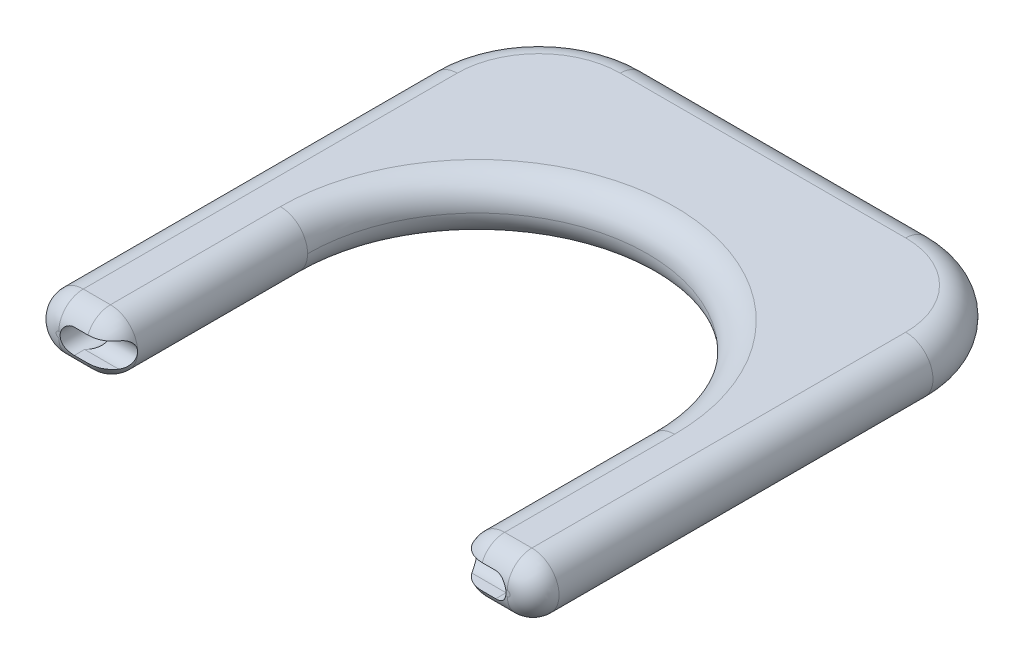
ISO-10303-21;
HEADER;
FILE_DESCRIPTION(('STEP AP214'),'2;1');
FILE_NAME('part.step','',(''),(''),'','','');
FILE_SCHEMA(('AUTOMOTIVE_DESIGN { 1 0 10303 214 1 1 1 1 }'));
ENDSEC;
DATA;
#1=APPLICATION_CONTEXT('core data for automotive mechanical design processes');
#2=APPLICATION_PROTOCOL_DEFINITION('international standard','automotive_design',2000,#1);
#3=PRODUCT_CONTEXT('',#1,'mechanical');
#4=PRODUCT('Part','Part','',(#3));
#5=PRODUCT_RELATED_PRODUCT_CATEGORY('part','',(#4));
#6=PRODUCT_DEFINITION_FORMATION('','',#4);
#7=PRODUCT_DEFINITION_CONTEXT('part definition',#1,'design');
#8=PRODUCT_DEFINITION('design','',#6,#7);
#9=PRODUCT_DEFINITION_SHAPE('','',#8);
#10=(LENGTH_UNIT() NAMED_UNIT(*) SI_UNIT(.MILLI.,.METRE.));
#11=(NAMED_UNIT(*) PLANE_ANGLE_UNIT() SI_UNIT($,.RADIAN.));
#12=(NAMED_UNIT(*) SI_UNIT($,.STERADIAN.) SOLID_ANGLE_UNIT());
#13=UNCERTAINTY_MEASURE_WITH_UNIT(LENGTH_MEASURE(1.E-05),#10,'distance_accuracy_value','');
#14=(GEOMETRIC_REPRESENTATION_CONTEXT(3) GLOBAL_UNCERTAINTY_ASSIGNED_CONTEXT((#13)) GLOBAL_UNIT_ASSIGNED_CONTEXT((#10,
#11,#12)) REPRESENTATION_CONTEXT('',''));
#15=CARTESIAN_POINT('',(0.,0.,0.));
#16=DIRECTION('',(0.,0.,1.));
#17=DIRECTION('',(1.,0.,0.));
#18=AXIS2_PLACEMENT_3D('',#15,#16,#17);
#19=CARTESIAN_POINT('',(32.,0.,0.));
#20=DIRECTION('',(0.,0.,-1.));
#21=DIRECTION('',(-1.,0.,0.));
#22=AXIS2_PLACEMENT_3D('',#19,#20,#21);
#23=PLANE('',#22);
#24=CARTESIAN_POINT('',(32.,0.,0.));
#25=DIRECTION('',(0.,0.,-1.));
#26=DIRECTION('',(-1.,0.,0.));
#27=AXIS2_PLACEMENT_3D('',#24,#25,#26);
#28=CIRCLE('',#27,0.199999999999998);
#29=CARTESIAN_POINT('',(32.,-0.199999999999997,0.));
#30=VERTEX_POINT('',#29);
#31=CARTESIAN_POINT('',(32.,0.199999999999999,0.));
#32=VERTEX_POINT('',#31);
#33=EDGE_CURVE('E648',#30,#32,#28,.F.);
#34=ORIENTED_EDGE('',*,*,#33,.T.);
#35=DIRECTION('',(1.,0.,0.));
#36=VECTOR('',#35,1.);
#37=CARTESIAN_POINT('',(30.,0.199999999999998,0.));
#38=LINE('',#37,#36);
#39=CARTESIAN_POINT('',(31.8774964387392,0.199999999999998,0.));
#40=VERTEX_POINT('',#39);
#41=EDGE_CURVE('E656',#32,#40,#38,.F.);
#42=ORIENTED_EDGE('',*,*,#41,.T.);
#43=CARTESIAN_POINT('',(31.,0.,0.));
#44=DIRECTION('',(0.,0.,1.));
#45=DIRECTION('',(1.,0.,0.));
#46=AXIS2_PLACEMENT_3D('',#43,#44,#45);
#47=CIRCLE('',#46,0.899999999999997);
#48=CARTESIAN_POINT('',(31.8774964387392,-0.199999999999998,0.));
#49=VERTEX_POINT('',#48);
#50=EDGE_CURVE('E531',#49,#40,#47,.T.);
#51=ORIENTED_EDGE('',*,*,#50,.F.);
#52=DIRECTION('',(-1.,0.,0.));
#53=VECTOR('',#52,1.);
#54=CARTESIAN_POINT('',(32.,-0.199999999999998,0.));
#55=LINE('',#54,#53);
#56=EDGE_CURVE('E649',#49,#30,#55,.F.);
#57=ORIENTED_EDGE('',*,*,#56,.T.);
#58=EDGE_LOOP('',(#34,#42,#51,#57));
#59=FACE_BOUND('',#58,.T.);
#60=ADVANCED_FACE('F41',(#59),#23,.F.);
#61=CARTESIAN_POINT('',(-1.,0.,0.));
#62=DIRECTION('',(0.,0.,1.));
#63=DIRECTION('',(1.,0.,0.));
#64=AXIS2_PLACEMENT_3D('',#61,#62,#63);
#65=PLANE('',#64);
#66=CARTESIAN_POINT('',(0.,0.,0.));
#67=DIRECTION('',(0.,0.,1.));
#68=DIRECTION('',(1.,0.,0.));
#69=AXIS2_PLACEMENT_3D('',#66,#67,#68);
#70=CIRCLE('',#69,0.9);
#71=CARTESIAN_POINT('',(-0.877496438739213,0.199999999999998,0.));
#72=VERTEX_POINT('',#71);
#73=CARTESIAN_POINT('',(-0.877496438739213,-0.199999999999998,0.));
#74=VERTEX_POINT('',#73);
#75=EDGE_CURVE('E521',#72,#74,#70,.T.);
#76=ORIENTED_EDGE('',*,*,#75,.F.);
#77=DIRECTION('',(-1.,0.,0.));
#78=VECTOR('',#77,1.);
#79=CARTESIAN_POINT('',(-1.,0.199999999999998,0.));
#80=LINE('',#79,#78);
#81=CARTESIAN_POINT('',(-1.,0.199999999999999,0.));
#82=VERTEX_POINT('',#81);
#83=EDGE_CURVE('E606',#72,#82,#80,.T.);
#84=ORIENTED_EDGE('',*,*,#83,.T.);
#85=CARTESIAN_POINT('',(-1.,0.,0.));
#86=DIRECTION('',(0.,0.,1.));
#87=DIRECTION('',(1.,0.,0.));
#88=AXIS2_PLACEMENT_3D('',#85,#86,#87);
#89=CIRCLE('',#88,0.199999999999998);
#90=CARTESIAN_POINT('',(-1.,-0.199999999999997,0.));
#91=VERTEX_POINT('',#90);
#92=EDGE_CURVE('E410',#82,#91,#89,.T.);
#93=ORIENTED_EDGE('',*,*,#92,.T.);
#94=DIRECTION('',(1.,0.,0.));
#95=VECTOR('',#94,1.);
#96=CARTESIAN_POINT('',(-1.,-0.199999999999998,0.));
#97=LINE('',#96,#95);
#98=EDGE_CURVE('E609',#91,#74,#97,.T.);
#99=ORIENTED_EDGE('',*,*,#98,.T.);
#100=EDGE_LOOP('',(#76,#84,#93,#99));
#101=FACE_BOUND('',#100,.T.);
#102=ADVANCED_FACE('F461',(#101),#65,.T.);
#103=CARTESIAN_POINT('',(30.,0.,0.));
#104=DIRECTION('',(0.,0.,-1.));
#105=DIRECTION('',(-1.,0.,0.));
#106=AXIS2_PLACEMENT_3D('',#103,#104,#105);
#107=CYLINDRICAL_SURFACE('',#106,2.);
#108=CARTESIAN_POINT('',(30.,0.,-1.8));
#109=DIRECTION('',(0.,0.,-1.));
#110=DIRECTION('',(-1.,0.,0.));
#111=AXIS2_PLACEMENT_3D('',#108,#109,#110);
#112=CIRCLE('',#111,2.);
#113=CARTESIAN_POINT('',(30.,-2.,-1.8));
#114=VERTEX_POINT('',#113);
#115=CARTESIAN_POINT('',(27.9999999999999,0.,-1.80000000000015));
#116=VERTEX_POINT('',#115);
#117=EDGE_CURVE('E350',#114,#116,#112,.T.);
#118=ORIENTED_EDGE('',*,*,#117,.T.);
#119=CARTESIAN_POINT('',(30.,0.,-1.8));
#120=DIRECTION('',(0.,0.,-1.));
#121=DIRECTION('',(-1.,0.,0.));
#122=AXIS2_PLACEMENT_3D('',#119,#120,#121);
#123=CIRCLE('',#122,2.);
#124=CARTESIAN_POINT('',(30.,2.,-1.8));
#125=VERTEX_POINT('',#124);
#126=EDGE_CURVE('E355',#116,#125,#123,.T.);
#127=ORIENTED_EDGE('',*,*,#126,.T.);
#128=DIRECTION('',(0.,0.,-1.));
#129=VECTOR('',#128,1.);
#130=CARTESIAN_POINT('',(30.,2.,0.));
#131=LINE('',#130,#129);
#132=CARTESIAN_POINT('',(30.,2.,-14.3));
#133=VERTEX_POINT('',#132);
#134=EDGE_CURVE('E516',#125,#133,#131,.T.);
#135=ORIENTED_EDGE('',*,*,#134,.T.);
#136=CARTESIAN_POINT('',(30.,0.,-14.3));
#137=DIRECTION('',(0.,0.,1.));
#138=DIRECTION('',(1.,0.,0.));
#139=AXIS2_PLACEMENT_3D('',#136,#137,#138);
#140=CIRCLE('',#139,2.);
#141=CARTESIAN_POINT('',(28.,0.,-14.3));
#142=VERTEX_POINT('',#141);
#143=EDGE_CURVE('E490',#142,#133,#140,.F.);
#144=ORIENTED_EDGE('',*,*,#143,.F.);
#145=CARTESIAN_POINT('',(30.,-2.,-14.3));
#146=VERTEX_POINT('',#145);
#147=EDGE_CURVE('E500',#146,#142,#140,.F.);
#148=ORIENTED_EDGE('',*,*,#147,.F.);
#149=DIRECTION('',(0.,0.,-1.));
#150=VECTOR('',#149,1.);
#151=CARTESIAN_POINT('',(30.,-2.,0.));
#152=LINE('',#151,#150);
#153=EDGE_CURVE('E498',#114,#146,#152,.T.);
#154=ORIENTED_EDGE('',*,*,#153,.F.);
#155=EDGE_LOOP('',(#118,#127,#135,#144,#148,#154));
#156=FACE_BOUND('',#155,.T.);
#157=ADVANCED_FACE('F467',(#156),#107,.T.);
#158=CARTESIAN_POINT('',(1.,0.,-29.305));
#159=DIRECTION('',(0.,0.,1.));
#160=DIRECTION('',(1.,0.,0.));
#161=AXIS2_PLACEMENT_3D('',#158,#159,#160);
#162=CYLINDRICAL_SURFACE('',#161,2.);
#163=DIRECTION('',(0.,0.,1.));
#164=VECTOR('',#163,1.);
#165=CARTESIAN_POINT('',(1.,2.,-29.305));
#166=LINE('',#165,#164);
#167=CARTESIAN_POINT('',(1.,2.,-14.3));
#168=VERTEX_POINT('',#167);
#169=CARTESIAN_POINT('',(1.,2.,-1.8));
#170=VERTEX_POINT('',#169);
#171=EDGE_CURVE('E560',#168,#170,#166,.T.);
#172=ORIENTED_EDGE('',*,*,#171,.T.);
#173=CARTESIAN_POINT('',(1.,0.,-1.8));
#174=DIRECTION('',(0.,0.,1.));
#175=DIRECTION('',(1.,0.,0.));
#176=AXIS2_PLACEMENT_3D('',#173,#174,#175);
#177=CIRCLE('',#176,2.);
#178=CARTESIAN_POINT('',(3.00000000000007,0.,-1.80000000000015));
#179=VERTEX_POINT('',#178);
#180=EDGE_CURVE('E618',#170,#179,#177,.F.);
#181=ORIENTED_EDGE('',*,*,#180,.T.);
#182=CARTESIAN_POINT('',(1.,0.,-1.8));
#183=DIRECTION('',(0.,0.,1.));
#184=DIRECTION('',(1.,0.,0.));
#185=AXIS2_PLACEMENT_3D('',#182,#183,#184);
#186=CIRCLE('',#185,2.);
#187=CARTESIAN_POINT('',(1.,-2.,-1.8));
#188=VERTEX_POINT('',#187);
#189=EDGE_CURVE('E385',#179,#188,#186,.F.);
#190=ORIENTED_EDGE('',*,*,#189,.T.);
#191=DIRECTION('',(0.,0.,1.));
#192=VECTOR('',#191,1.);
#193=CARTESIAN_POINT('',(1.,-2.,-29.305));
#194=LINE('',#193,#192);
#195=CARTESIAN_POINT('',(1.,-2.,-14.3));
#196=VERTEX_POINT('',#195);
#197=EDGE_CURVE('E496',#196,#188,#194,.T.);
#198=ORIENTED_EDGE('',*,*,#197,.F.);
#199=CARTESIAN_POINT('',(1.,0.,-14.3));
#200=DIRECTION('',(0.,0.,1.));
#201=DIRECTION('',(1.,0.,0.));
#202=AXIS2_PLACEMENT_3D('',#199,#200,#201);
#203=CIRCLE('',#202,2.);
#204=CARTESIAN_POINT('',(3.,0.,-14.3));
#205=VERTEX_POINT('',#204);
#206=EDGE_CURVE('E482',#205,#196,#203,.F.);
#207=ORIENTED_EDGE('',*,*,#206,.F.);
#208=EDGE_CURVE('E491',#168,#205,#203,.F.);
#209=ORIENTED_EDGE('',*,*,#208,.F.);
#210=EDGE_LOOP('',(#172,#181,#190,#198,#207,#209));
#211=FACE_BOUND('',#210,.T.);
#212=ADVANCED_FACE('F422',(#211),#162,.T.);
#213=CARTESIAN_POINT('',(0.,0.,-26.));
#214=DIRECTION('',(0.,0.,1.));
#215=DIRECTION('',(1.,0.,0.));
#216=AXIS2_PLACEMENT_3D('',#213,#214,#215);
#217=CYLINDRICAL_SURFACE('',#216,0.9);
#218=CARTESIAN_POINT('',(0.,0.,-26.));
#219=DIRECTION('',(0.,0.,1.));
#220=DIRECTION('',(1.,0.,0.));
#221=AXIS2_PLACEMENT_3D('',#218,#219,#220);
#222=CIRCLE('',#221,0.9);
#223=CARTESIAN_POINT('',(0.9,0.,-26.));
#224=VERTEX_POINT('',#223);
#225=EDGE_CURVE('E517',#224,#224,#222,.T.);
#226=ORIENTED_EDGE('',*,*,#225,.F.);
#227=EDGE_LOOP('',(#226));
#228=FACE_BOUND('',#227,.T.);
#229=DIRECTION('',(0.,0.,1.));
#230=VECTOR('',#229,1.);
#231=CARTESIAN_POINT('',(0.,0.9,0.));
#232=LINE('',#231,#230);
#233=CARTESIAN_POINT('',(0.,0.899999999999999,-0.9));
#234=VERTEX_POINT('',#233);
#235=CARTESIAN_POINT('',(0.,0.9,-0.141687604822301));
#236=VERTEX_POINT('',#235);
#237=EDGE_CURVE('E233',#234,#236,#232,.T.);
#238=ORIENTED_EDGE('',*,*,#237,.T.);
#239=CARTESIAN_POINT('',(-0.877496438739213,0.199999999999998,0.));
#240=CARTESIAN_POINT('',(-0.872085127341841,0.223747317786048,2.31582791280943E-06));
#241=CARTESIAN_POINT('',(-0.8657102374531,0.247260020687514,-0.000470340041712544));
#242=CARTESIAN_POINT('',(-0.851093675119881,0.293650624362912,-0.0022884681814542));
#243=CARTESIAN_POINT('',(-0.842852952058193,0.31652884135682,-0.00363349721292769));
#244=CARTESIAN_POINT('',(-0.815504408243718,0.383774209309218,-0.00884488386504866));
#245=CARTESIAN_POINT('',(-0.793714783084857,0.426992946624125,-0.0138890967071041));
#246=CARTESIAN_POINT('',(-0.743751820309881,0.509060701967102,-0.0262448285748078));
#247=CARTESIAN_POINT('',(-0.715588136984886,0.54791619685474,-0.0335529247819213));
#248=CARTESIAN_POINT('',(-0.653582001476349,0.620575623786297,-0.0494284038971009));
#249=CARTESIAN_POINT('',(-0.61973244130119,0.654373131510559,-0.0579973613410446));
#250=CARTESIAN_POINT('',(-0.545115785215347,0.717900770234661,-0.0757818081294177));
#251=CARTESIAN_POINT('',(-0.504068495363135,0.747299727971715,-0.0850067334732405));
#252=CARTESIAN_POINT('',(-0.417477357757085,0.798906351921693,-0.102338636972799));
#253=CARTESIAN_POINT('',(-0.371935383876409,0.82111699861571,-0.110446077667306));
#254=CARTESIAN_POINT('',(-0.27695481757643,0.857853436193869,-0.124403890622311));
#255=CARTESIAN_POINT('',(-0.227481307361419,0.87229877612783,-0.130230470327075));
#256=CARTESIAN_POINT('',(-0.126519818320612,0.892547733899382,-0.13852441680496));
#257=CARTESIAN_POINT('',(-0.0750323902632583,0.898353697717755,-0.140992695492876));
#258=CARTESIAN_POINT('',(0.0244385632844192,0.900939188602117,-0.142084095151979));
#259=CARTESIAN_POINT('',(0.0724019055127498,0.89834993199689,-0.140976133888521));
#260=CARTESIAN_POINT('',(0.143460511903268,0.888816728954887,-0.137008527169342));
#261=CARTESIAN_POINT('',(0.167034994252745,0.884686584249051,-0.135297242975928));
#262=CARTESIAN_POINT('',(0.213721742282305,0.874581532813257,-0.131177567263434));
#263=CARTESIAN_POINT('',(0.236834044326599,0.868606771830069,-0.128769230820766));
#264=CARTESIAN_POINT('',(0.259647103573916,0.861732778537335,-0.126049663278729));
#265=B_SPLINE_CURVE_WITH_KNOTS('',3,(#239,#240,#241,#242,#243,#244,#245,#246,#247,#248,#249,
#250,#251,#252,#253,#254,#255,#256,#257,#258,#259,#260,#261,#262,#263,#264),.UNSPECIFIED.,.F.,
.F.,(4,2,2,2,2,2,2,2,2,2,2,2,4),(0.,0.0730161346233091,0.145995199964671,0.291222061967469,
0.436230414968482,0.581421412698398,0.73469517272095,0.887905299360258,1.04267354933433,
1.19739976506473,1.34076991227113,1.41267928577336,1.48458297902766),.UNSPECIFIED.);
#266=EDGE_CURVE('E403',#236,#72,#265,.F.);
#267=ORIENTED_EDGE('',*,*,#266,.T.);
#268=ORIENTED_EDGE('',*,*,#75,.T.);
#269=CARTESIAN_POINT('',(-0.877496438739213,-0.199999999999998,0.));
#270=CARTESIAN_POINT('',(-0.872085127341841,-0.223747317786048,2.31582791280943E-06));
#271=CARTESIAN_POINT('',(-0.8657102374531,-0.247260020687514,-0.000470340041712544));
#272=CARTESIAN_POINT('',(-0.851093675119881,-0.293650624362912,-0.0022884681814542));
#273=CARTESIAN_POINT('',(-0.842852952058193,-0.31652884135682,-0.00363349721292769));
#274=CARTESIAN_POINT('',(-0.815504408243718,-0.383774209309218,-0.00884488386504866));
#275=CARTESIAN_POINT('',(-0.793714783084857,-0.426992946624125,-0.0138890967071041));
#276=CARTESIAN_POINT('',(-0.743751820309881,-0.509060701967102,-0.0262448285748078));
#277=CARTESIAN_POINT('',(-0.715588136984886,-0.54791619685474,-0.0335529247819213));
#278=CARTESIAN_POINT('',(-0.653582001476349,-0.620575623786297,-0.0494284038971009));
#279=CARTESIAN_POINT('',(-0.61973244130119,-0.654373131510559,-0.0579973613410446));
#280=CARTESIAN_POINT('',(-0.545115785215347,-0.717900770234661,-0.0757818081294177));
#281=CARTESIAN_POINT('',(-0.504068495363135,-0.747299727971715,-0.0850067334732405));
#282=CARTESIAN_POINT('',(-0.417477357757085,-0.798906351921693,-0.102338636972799));
#283=CARTESIAN_POINT('',(-0.371935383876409,-0.82111699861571,-0.110446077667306));
#284=CARTESIAN_POINT('',(-0.27695481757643,-0.857853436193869,-0.124403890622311));
#285=CARTESIAN_POINT('',(-0.227481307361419,-0.87229877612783,-0.130230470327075));
#286=CARTESIAN_POINT('',(-0.126519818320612,-0.892547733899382,-0.13852441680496));
#287=CARTESIAN_POINT('',(-0.0750323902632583,-0.898353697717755,-0.140992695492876));
#288=CARTESIAN_POINT('',(0.0244385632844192,-0.900939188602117,-0.142084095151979));
#289=CARTESIAN_POINT('',(0.0724019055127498,-0.89834993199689,-0.140976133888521));
#290=CARTESIAN_POINT('',(0.143460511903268,-0.888816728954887,-0.137008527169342));
#291=CARTESIAN_POINT('',(0.167034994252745,-0.884686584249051,-0.135297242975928));
#292=CARTESIAN_POINT('',(0.213721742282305,-0.874581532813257,-0.131177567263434));
#293=CARTESIAN_POINT('',(0.236834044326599,-0.868606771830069,-0.128769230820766));
#294=CARTESIAN_POINT('',(0.259647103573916,-0.861732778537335,-0.126049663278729));
#295=B_SPLINE_CURVE_WITH_KNOTS('',3,(#269,#270,#271,#272,#273,#274,#275,#276,#277,#278,#279,
#280,#281,#282,#283,#284,#285,#286,#287,#288,#289,#290,#291,#292,#293,#294),.UNSPECIFIED.,.F.,
.F.,(4,2,2,2,2,2,2,2,2,2,2,2,4),(0.,0.0730161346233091,0.145995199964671,0.291222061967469,
0.436230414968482,0.581421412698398,0.73469517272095,0.887905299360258,1.04267354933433,
1.19739976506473,1.34076991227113,1.41267928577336,1.48458297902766),.UNSPECIFIED.);
#296=CARTESIAN_POINT('',(0.,-0.9,-0.141687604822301));
#297=VERTEX_POINT('',#296);
#298=EDGE_CURVE('E411',#74,#297,#295,.T.);
#299=ORIENTED_EDGE('',*,*,#298,.T.);
#300=DIRECTION('',(0.,0.,-1.));
#301=VECTOR('',#300,1.);
#302=CARTESIAN_POINT('',(0.,-0.9,0.));
#303=LINE('',#302,#301);
#304=CARTESIAN_POINT('',(0.,-0.9,-0.9));
#305=VERTEX_POINT('',#304);
#306=EDGE_CURVE('E332',#297,#305,#303,.T.);
#307=ORIENTED_EDGE('',*,*,#306,.T.);
#308=CARTESIAN_POINT('',(0.,0.,-0.900000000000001));
#309=DIRECTION('',(0.707106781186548,0.,0.707106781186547));
#310=DIRECTION('',(-0.707106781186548,0.,0.707106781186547));
#311=AXIS2_PLACEMENT_3D('',#308,#309,#310);
#312=ELLIPSE('',#311,1.27279220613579,0.9);
#313=EDGE_CURVE('E242',#234,#305,#312,.F.);
#314=ORIENTED_EDGE('',*,*,#313,.F.);
#315=EDGE_LOOP('',(#238,#267,#268,#299,#307,#314));
#316=FACE_BOUND('',#315,.T.);
#317=ADVANCED_FACE('F417',(#228,#316),#217,.F.);
#318=CARTESIAN_POINT('',(32.,2.,0.));
#319=DIRECTION('',(0.,1.,0.));
#320=DIRECTION('',(0.,0.,1.));
#321=AXIS2_PLACEMENT_3D('',#318,#319,#320);
#322=PLANE('',#321);
#323=DIRECTION('',(0.,0.,1.));
#324=VECTOR('',#323,1.);
#325=CARTESIAN_POINT('',(-1.,2.,-29.305));
#326=LINE('',#325,#324);
#327=CARTESIAN_POINT('',(-1.,2.,-29.305));
#328=VERTEX_POINT('',#327);
#329=CARTESIAN_POINT('',(-1.,2.,-1.8));
#330=VERTEX_POINT('',#329);
#331=EDGE_CURVE('E507',#328,#330,#326,.T.);
#332=ORIENTED_EDGE('',*,*,#331,.T.);
#333=DIRECTION('',(-1.,0.,0.));
#334=VECTOR('',#333,1.);
#335=CARTESIAN_POINT('',(32.,2.,-1.8));
#336=LINE('',#335,#334);
#337=EDGE_CURVE('E598',#330,#170,#336,.F.);
#338=ORIENTED_EDGE('',*,*,#337,.T.);
#339=ORIENTED_EDGE('',*,*,#171,.F.);
#340=CARTESIAN_POINT('',(15.5,2.,-14.3));
#341=DIRECTION('',(0.,1.,0.));
#342=DIRECTION('',(0.,0.,1.));
#343=AXIS2_PLACEMENT_3D('',#340,#341,#342);
#344=CIRCLE('',#343,14.5);
#345=EDGE_CURVE('E250',#168,#133,#344,.F.);
#346=ORIENTED_EDGE('',*,*,#345,.T.);
#347=ORIENTED_EDGE('',*,*,#134,.F.);
#348=DIRECTION('',(1.,0.,0.));
#349=VECTOR('',#348,1.);
#350=CARTESIAN_POINT('',(32.,2.,-1.8));
#351=LINE('',#350,#349);
#352=CARTESIAN_POINT('',(32.,2.,-1.8));
#353=VERTEX_POINT('',#352);
#354=EDGE_CURVE('E605',#125,#353,#351,.T.);
#355=ORIENTED_EDGE('',*,*,#354,.T.);
#356=DIRECTION('',(0.,0.,-1.));
#357=VECTOR('',#356,1.);
#358=CARTESIAN_POINT('',(32.,2.,0.));
#359=LINE('',#358,#357);
#360=CARTESIAN_POINT('',(32.,2.,-29.305));
#361=VERTEX_POINT('',#360);
#362=EDGE_CURVE('E535',#353,#361,#359,.T.);
#363=ORIENTED_EDGE('',*,*,#362,.T.);
#364=CARTESIAN_POINT('',(26.,2.,-29.305));
#365=DIRECTION('',(0.,1.,0.));
#366=DIRECTION('',(1.,0.,0.));
#367=AXIS2_PLACEMENT_3D('',#364,#365,#366);
#368=CIRCLE('',#367,6.);
#369=CARTESIAN_POINT('',(26.,2.,-35.305));
#370=VERTEX_POINT('',#369);
#371=EDGE_CURVE('E540',#361,#370,#368,.T.);
#372=ORIENTED_EDGE('',*,*,#371,.T.);
#373=DIRECTION('',(-1.,0.,0.));
#374=VECTOR('',#373,1.);
#375=CARTESIAN_POINT('',(26.,2.,-35.305));
#376=LINE('',#375,#374);
#377=CARTESIAN_POINT('',(5.,2.,-35.305));
#378=VERTEX_POINT('',#377);
#379=EDGE_CURVE('E546',#370,#378,#376,.T.);
#380=ORIENTED_EDGE('',*,*,#379,.T.);
#381=CARTESIAN_POINT('',(5.,2.,-29.305));
#382=DIRECTION('',(0.,1.,0.));
#383=DIRECTION('',(0.,0.,-1.));
#384=AXIS2_PLACEMENT_3D('',#381,#382,#383);
#385=CIRCLE('',#384,6.);
#386=EDGE_CURVE('E553',#378,#328,#385,.T.);
#387=ORIENTED_EDGE('',*,*,#386,.T.);
#388=EDGE_LOOP('',(#332,#338,#339,#346,#347,#355,#363,#372,#380,#387));
#389=FACE_BOUND('',#388,.T.);
#390=ADVANCED_FACE('F421',(#389),#322,.T.);
#391=CARTESIAN_POINT('',(32.,0.,0.));
#392=DIRECTION('',(0.,0.,-1.));
#393=DIRECTION('',(-1.,0.,0.));
#394=AXIS2_PLACEMENT_3D('',#391,#392,#393);
#395=CYLINDRICAL_SURFACE('',#394,2.);
#396=ORIENTED_EDGE('',*,*,#362,.F.);
#397=CARTESIAN_POINT('',(32.,0.,-1.8));
#398=DIRECTION('',(0.,0.,-1.));
#399=DIRECTION('',(-1.,0.,0.));
#400=AXIS2_PLACEMENT_3D('',#397,#398,#399);
#401=CIRCLE('',#400,2.);
#402=CARTESIAN_POINT('',(32.,-2.,-1.8));
#403=VERTEX_POINT('',#402);
#404=EDGE_CURVE('E11',#353,#403,#401,.T.);
#405=ORIENTED_EDGE('',*,*,#404,.T.);
#406=DIRECTION('',(0.,0.,-1.));
#407=VECTOR('',#406,1.);
#408=CARTESIAN_POINT('',(32.,-2.,0.));
#409=LINE('',#408,#407);
#410=CARTESIAN_POINT('',(32.,-2.,-29.305));
#411=VERTEX_POINT('',#410);
#412=EDGE_CURVE('E564',#403,#411,#409,.T.);
#413=ORIENTED_EDGE('',*,*,#412,.T.);
#414=CARTESIAN_POINT('',(32.,0.,-29.305));
#415=DIRECTION('',(0.,0.,-1.));
#416=DIRECTION('',(-1.,0.,0.));
#417=AXIS2_PLACEMENT_3D('',#414,#415,#416);
#418=CIRCLE('',#417,2.);
#419=EDGE_CURVE('E536',#361,#411,#418,.T.);
#420=ORIENTED_EDGE('',*,*,#419,.F.);
#421=EDGE_LOOP('',(#396,#405,#413,#420));
#422=FACE_BOUND('',#421,.T.);
#423=ADVANCED_FACE('F663',(#422),#395,.T.);
#424=CARTESIAN_POINT('',(32.,-2.,0.));
#425=DIRECTION('',(0.,-1.,0.));
#426=DIRECTION('',(0.,0.,-1.));
#427=AXIS2_PLACEMENT_3D('',#424,#425,#426);
#428=PLANE('',#427);
#429=ORIENTED_EDGE('',*,*,#412,.F.);
#430=DIRECTION('',(-1.,0.,0.));
#431=VECTOR('',#430,1.);
#432=CARTESIAN_POINT('',(30.,-2.,-1.8));
#433=LINE('',#432,#431);
#434=EDGE_CURVE('E298',#403,#114,#433,.T.);
#435=ORIENTED_EDGE('',*,*,#434,.T.);
#436=ORIENTED_EDGE('',*,*,#153,.T.);
#437=CARTESIAN_POINT('',(15.5,-2.,-14.3));
#438=DIRECTION('',(0.,-1.,0.));
#439=DIRECTION('',(0.,0.,-1.));
#440=AXIS2_PLACEMENT_3D('',#437,#438,#439);
#441=CIRCLE('',#440,14.5);
#442=EDGE_CURVE('E256',#146,#196,#441,.F.);
#443=ORIENTED_EDGE('',*,*,#442,.T.);
#444=ORIENTED_EDGE('',*,*,#197,.T.);
#445=DIRECTION('',(1.,0.,0.));
#446=VECTOR('',#445,1.);
#447=CARTESIAN_POINT('',(32.,-2.,-1.8));
#448=LINE('',#447,#446);
#449=CARTESIAN_POINT('',(-1.,-2.,-1.8));
#450=VERTEX_POINT('',#449);
#451=EDGE_CURVE('E356',#188,#450,#448,.F.);
#452=ORIENTED_EDGE('',*,*,#451,.T.);
#453=DIRECTION('',(0.,0.,1.));
#454=VECTOR('',#453,1.);
#455=CARTESIAN_POINT('',(-1.,-2.,-29.305));
#456=LINE('',#455,#454);
#457=CARTESIAN_POINT('',(-1.,-2.,-29.305));
#458=VERTEX_POINT('',#457);
#459=EDGE_CURVE('E504',#458,#450,#456,.T.);
#460=ORIENTED_EDGE('',*,*,#459,.F.);
#461=CARTESIAN_POINT('',(5.,-2.,-29.305));
#462=DIRECTION('',(0.,1.,0.));
#463=DIRECTION('',(0.,0.,-1.));
#464=AXIS2_PLACEMENT_3D('',#461,#462,#463);
#465=CIRCLE('',#464,6.);
#466=CARTESIAN_POINT('',(5.,-2.,-35.305));
#467=VERTEX_POINT('',#466);
#468=EDGE_CURVE('E579',#467,#458,#465,.T.);
#469=ORIENTED_EDGE('',*,*,#468,.F.);
#470=DIRECTION('',(-1.,0.,0.));
#471=VECTOR('',#470,1.);
#472=CARTESIAN_POINT('',(26.,-2.,-35.305));
#473=LINE('',#472,#471);
#474=CARTESIAN_POINT('',(26.,-2.,-35.305));
#475=VERTEX_POINT('',#474);
#476=EDGE_CURVE('E574',#475,#467,#473,.T.);
#477=ORIENTED_EDGE('',*,*,#476,.F.);
#478=CARTESIAN_POINT('',(26.,-2.,-29.305));
#479=DIRECTION('',(0.,1.,0.));
#480=DIRECTION('',(1.,0.,0.));
#481=AXIS2_PLACEMENT_3D('',#478,#479,#480);
#482=CIRCLE('',#481,6.);
#483=EDGE_CURVE('E569',#411,#475,#482,.T.);
#484=ORIENTED_EDGE('',*,*,#483,.F.);
#485=EDGE_LOOP('',(#429,#435,#436,#443,#444,#452,#460,#469,#477,#484));
#486=FACE_BOUND('',#485,.T.);
#487=ADVANCED_FACE('F495',(#486),#428,.T.);
#488=CARTESIAN_POINT('',(26.,0.,-29.305));
#489=DIRECTION('',(0.,1.,0.));
#490=DIRECTION('',(0.,0.,1.));
#491=AXIS2_PLACEMENT_3D('',#488,#489,#490);
#492=TOROIDAL_SURFACE('',#491,6.,2.);
#493=ORIENTED_EDGE('',*,*,#483,.T.);
#494=CARTESIAN_POINT('',(26.,0.,-35.305));
#495=DIRECTION('',(-1.,0.,0.));
#496=DIRECTION('',(0.,0.,1.));
#497=AXIS2_PLACEMENT_3D('',#494,#495,#496);
#498=CIRCLE('',#497,2.);
#499=EDGE_CURVE('E543',#370,#475,#498,.T.);
#500=ORIENTED_EDGE('',*,*,#499,.F.);
#501=ORIENTED_EDGE('',*,*,#371,.F.);
#502=ORIENTED_EDGE('',*,*,#419,.T.);
#503=EDGE_LOOP('',(#493,#500,#501,#502));
#504=FACE_BOUND('',#503,.T.);
#505=ADVANCED_FACE('F669',(#504),#492,.T.);
#506=CARTESIAN_POINT('',(26.,0.,-35.305));
#507=DIRECTION('',(-1.,0.,0.));
#508=DIRECTION('',(0.,0.,1.));
#509=AXIS2_PLACEMENT_3D('',#506,#507,#508);
#510=CYLINDRICAL_SURFACE('',#509,2.);
#511=ORIENTED_EDGE('',*,*,#476,.T.);
#512=CARTESIAN_POINT('',(5.,0.,-35.305));
#513=DIRECTION('',(-1.,0.,0.));
#514=DIRECTION('',(0.,0.,1.));
#515=AXIS2_PLACEMENT_3D('',#512,#513,#514);
#516=CIRCLE('',#515,2.);
#517=EDGE_CURVE('E550',#378,#467,#516,.T.);
#518=ORIENTED_EDGE('',*,*,#517,.F.);
#519=ORIENTED_EDGE('',*,*,#379,.F.);
#520=ORIENTED_EDGE('',*,*,#499,.T.);
#521=EDGE_LOOP('',(#511,#518,#519,#520));
#522=FACE_BOUND('',#521,.T.);
#523=ADVANCED_FACE('F673',(#522),#510,.T.);
#524=CARTESIAN_POINT('',(5.,0.,-29.305));
#525=DIRECTION('',(0.,1.,0.));
#526=DIRECTION('',(0.,0.,1.));
#527=AXIS2_PLACEMENT_3D('',#524,#525,#526);
#528=TOROIDAL_SURFACE('',#527,6.,2.);
#529=ORIENTED_EDGE('',*,*,#468,.T.);
#530=CARTESIAN_POINT('',(-1.,0.,-29.305));
#531=DIRECTION('',(0.,0.,1.));
#532=DIRECTION('',(1.,0.,0.));
#533=AXIS2_PLACEMENT_3D('',#530,#531,#532);
#534=CIRCLE('',#533,2.);
#535=EDGE_CURVE('E557',#328,#458,#534,.T.);
#536=ORIENTED_EDGE('',*,*,#535,.F.);
#537=ORIENTED_EDGE('',*,*,#386,.F.);
#538=ORIENTED_EDGE('',*,*,#517,.T.);
#539=EDGE_LOOP('',(#529,#536,#537,#538));
#540=FACE_BOUND('',#539,.T.);
#541=ADVANCED_FACE('F588',(#540),#528,.T.);
#542=CARTESIAN_POINT('',(-1.,0.,-29.305));
#543=DIRECTION('',(0.,0.,1.));
#544=DIRECTION('',(1.,0.,0.));
#545=AXIS2_PLACEMENT_3D('',#542,#543,#544);
#546=CYLINDRICAL_SURFACE('',#545,2.);
#547=ORIENTED_EDGE('',*,*,#459,.T.);
#548=CARTESIAN_POINT('',(-1.,0.,-1.8));
#549=DIRECTION('',(0.,0.,1.));
#550=DIRECTION('',(1.,0.,0.));
#551=AXIS2_PLACEMENT_3D('',#548,#549,#550);
#552=CIRCLE('',#551,2.);
#553=EDGE_CURVE('E51',#450,#330,#552,.F.);
#554=ORIENTED_EDGE('',*,*,#553,.T.);
#555=ORIENTED_EDGE('',*,*,#331,.F.);
#556=ORIENTED_EDGE('',*,*,#535,.T.);
#557=EDGE_LOOP('',(#547,#554,#555,#556));
#558=FACE_BOUND('',#557,.T.);
#559=ADVANCED_FACE('F424',(#558),#546,.T.);
#560=CARTESIAN_POINT('',(15.5,0.,-14.3));
#561=DIRECTION('',(0.,1.,0.));
#562=DIRECTION('',(0.,0.,1.));
#563=AXIS2_PLACEMENT_3D('',#560,#561,#562);
#564=TOROIDAL_SURFACE('',#563,14.5,2.);
#565=ORIENTED_EDGE('',*,*,#345,.F.);
#566=ORIENTED_EDGE('',*,*,#208,.T.);
#567=CARTESIAN_POINT('',(15.5,0.,-14.3));
#568=DIRECTION('',(0.,1.,0.));
#569=DIRECTION('',(0.,0.,1.));
#570=AXIS2_PLACEMENT_3D('',#567,#568,#569);
#571=CIRCLE('',#570,12.5);
#572=EDGE_CURVE('E259',#142,#205,#571,.T.);
#573=ORIENTED_EDGE('',*,*,#572,.F.);
#574=ORIENTED_EDGE('',*,*,#143,.T.);
#575=EDGE_LOOP('',(#565,#566,#573,#574));
#576=FACE_BOUND('',#575,.T.);
#577=ADVANCED_FACE('F395',(#576),#564,.T.);
#578=CARTESIAN_POINT('',(15.5,0.,-14.3));
#579=DIRECTION('',(0.,-1.,0.));
#580=DIRECTION('',(0.,0.,-1.));
#581=AXIS2_PLACEMENT_3D('',#578,#579,#580);
#582=TOROIDAL_SURFACE('',#581,14.5,2.);
#583=ORIENTED_EDGE('',*,*,#206,.T.);
#584=ORIENTED_EDGE('',*,*,#442,.F.);
#585=ORIENTED_EDGE('',*,*,#147,.T.);
#586=ORIENTED_EDGE('',*,*,#572,.T.);
#587=EDGE_LOOP('',(#583,#584,#585,#586));
#588=FACE_BOUND('',#587,.T.);
#589=ADVANCED_FACE('F471',(#588),#582,.T.);
#590=CARTESIAN_POINT('',(0.,0.,-26.));
#591=DIRECTION('',(0.,0.,1.));
#592=DIRECTION('',(1.,0.,0.));
#593=AXIS2_PLACEMENT_3D('',#590,#591,#592);
#594=PLANE('',#593);
#595=ORIENTED_EDGE('',*,*,#225,.T.);
#596=EDGE_LOOP('',(#595));
#597=FACE_BOUND('',#596,.T.);
#598=ADVANCED_FACE('F308',(#597),#594,.T.);
#599=CARTESIAN_POINT('',(31.,0.,-26.));
#600=DIRECTION('',(0.,0.,1.));
#601=DIRECTION('',(1.,0.,0.));
#602=AXIS2_PLACEMENT_3D('',#599,#600,#601);
#603=CYLINDRICAL_SURFACE('',#602,0.899999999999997);
#604=CARTESIAN_POINT('',(31.,0.,-26.));
#605=DIRECTION('',(0.,0.,1.));
#606=DIRECTION('',(1.,0.,0.));
#607=AXIS2_PLACEMENT_3D('',#604,#605,#606);
#608=CIRCLE('',#607,0.899999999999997);
#609=CARTESIAN_POINT('',(31.9,0.,-26.));
#610=VERTEX_POINT('',#609);
#611=EDGE_CURVE('E525',#610,#610,#608,.T.);
#612=ORIENTED_EDGE('',*,*,#611,.F.);
#613=EDGE_LOOP('',(#612));
#614=FACE_BOUND('',#613,.T.);
#615=ORIENTED_EDGE('',*,*,#50,.T.);
#616=CARTESIAN_POINT('',(31.8774964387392,0.199999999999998,0.));
#617=CARTESIAN_POINT('',(31.8720851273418,0.223747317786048,2.31582791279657E-06));
#618=CARTESIAN_POINT('',(31.8657102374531,0.247260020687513,-0.000470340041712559));
#619=CARTESIAN_POINT('',(31.8510936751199,0.293650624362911,-0.00228846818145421));
#620=CARTESIAN_POINT('',(31.8428529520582,0.316528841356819,-0.0036334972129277));
#621=CARTESIAN_POINT('',(31.8155044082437,0.383774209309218,-0.0088448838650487));
#622=CARTESIAN_POINT('',(31.7937147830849,0.426992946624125,-0.0138890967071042));
#623=CARTESIAN_POINT('',(31.7437518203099,0.509060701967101,-0.0262448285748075));
#624=CARTESIAN_POINT('',(31.7155881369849,0.547916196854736,-0.0335529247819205));
#625=CARTESIAN_POINT('',(31.6535820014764,0.620575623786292,-0.0494284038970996));
#626=CARTESIAN_POINT('',(31.6197324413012,0.654373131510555,-0.0579973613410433));
#627=CARTESIAN_POINT('',(31.5451157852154,0.717900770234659,-0.0757818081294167));
#628=CARTESIAN_POINT('',(31.5040684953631,0.747299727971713,-0.0850067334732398));
#629=CARTESIAN_POINT('',(31.4174773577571,0.798906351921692,-0.102338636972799));
#630=CARTESIAN_POINT('',(31.3719353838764,0.821116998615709,-0.110446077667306));
#631=CARTESIAN_POINT('',(31.2769548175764,0.857853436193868,-0.12440389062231));
#632=CARTESIAN_POINT('',(31.2274813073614,0.872298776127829,-0.130230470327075));
#633=CARTESIAN_POINT('',(31.1265198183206,0.892547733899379,-0.138524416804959));
#634=CARTESIAN_POINT('',(31.0750323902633,0.898353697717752,-0.140992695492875));
#635=CARTESIAN_POINT('',(30.9755614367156,0.900939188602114,-0.142084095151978));
#636=CARTESIAN_POINT('',(30.9275980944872,0.898349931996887,-0.140976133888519));
#637=CARTESIAN_POINT('',(30.8565394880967,0.888816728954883,-0.13700852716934));
#638=CARTESIAN_POINT('',(30.8329650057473,0.884686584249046,-0.135297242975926));
#639=CARTESIAN_POINT('',(30.7862782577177,0.874581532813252,-0.131177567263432));
#640=CARTESIAN_POINT('',(30.7631659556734,0.868606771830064,-0.128769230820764));
#641=CARTESIAN_POINT('',(30.7403528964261,0.861732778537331,-0.126049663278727));
#642=B_SPLINE_CURVE_WITH_KNOTS('',3,(#616,#617,#618,#619,#620,#621,#622,#623,#624,#625,#626,
#627,#628,#629,#630,#631,#632,#633,#634,#635,#636,#637,#638,#639,#640,#641),.UNSPECIFIED.,.F.,
.F.,(4,2,2,2,2,2,2,2,2,2,2,2,4),(0.,0.0730161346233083,0.14599519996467,0.29122206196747,
0.436230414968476,0.581421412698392,0.734695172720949,0.887905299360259,1.04267354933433,
1.19739976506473,1.34076991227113,1.41267928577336,1.48458297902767),.UNSPECIFIED.);
#643=CARTESIAN_POINT('',(31.,0.9,-0.141687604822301));
#644=VERTEX_POINT('',#643);
#645=EDGE_CURVE('E443',#40,#644,#642,.T.);
#646=ORIENTED_EDGE('',*,*,#645,.T.);
#647=DIRECTION('',(0.,0.,1.));
#648=VECTOR('',#647,1.);
#649=CARTESIAN_POINT('',(31.,0.9,0.));
#650=LINE('',#649,#648);
#651=CARTESIAN_POINT('',(31.,0.899999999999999,-0.9));
#652=VERTEX_POINT('',#651);
#653=EDGE_CURVE('E232',#652,#644,#650,.T.);
#654=ORIENTED_EDGE('',*,*,#653,.F.);
#655=CARTESIAN_POINT('',(31.,0.,-0.900000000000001));
#656=DIRECTION('',(-0.707106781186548,0.,0.707106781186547));
#657=DIRECTION('',(0.707106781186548,0.,0.707106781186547));
#658=AXIS2_PLACEMENT_3D('',#655,#656,#657);
#659=ELLIPSE('',#658,1.27279220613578,0.899999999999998);
#660=CARTESIAN_POINT('',(31.,-0.900000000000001,-0.9));
#661=VERTEX_POINT('',#660);
#662=EDGE_CURVE('E238',#661,#652,#659,.F.);
#663=ORIENTED_EDGE('',*,*,#662,.F.);
#664=DIRECTION('',(0.,0.,-1.));
#665=VECTOR('',#664,1.);
#666=CARTESIAN_POINT('',(31.,-0.9,0.));
#667=LINE('',#666,#665);
#668=CARTESIAN_POINT('',(31.,-0.9,-0.141687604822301));
#669=VERTEX_POINT('',#668);
#670=EDGE_CURVE('E225',#669,#661,#667,.T.);
#671=ORIENTED_EDGE('',*,*,#670,.F.);
#672=CARTESIAN_POINT('',(31.8774964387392,-0.199999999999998,0.));
#673=CARTESIAN_POINT('',(31.8720851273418,-0.223747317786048,2.31582791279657E-06));
#674=CARTESIAN_POINT('',(31.8657102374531,-0.247260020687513,-0.000470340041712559));
#675=CARTESIAN_POINT('',(31.8510936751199,-0.293650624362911,-0.00228846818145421));
#676=CARTESIAN_POINT('',(31.8428529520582,-0.316528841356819,-0.0036334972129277));
#677=CARTESIAN_POINT('',(31.8155044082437,-0.383774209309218,-0.0088448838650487));
#678=CARTESIAN_POINT('',(31.7937147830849,-0.426992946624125,-0.0138890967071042));
#679=CARTESIAN_POINT('',(31.7437518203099,-0.509060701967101,-0.0262448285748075));
#680=CARTESIAN_POINT('',(31.7155881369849,-0.547916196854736,-0.0335529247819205));
#681=CARTESIAN_POINT('',(31.6535820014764,-0.620575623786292,-0.0494284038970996));
#682=CARTESIAN_POINT('',(31.6197324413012,-0.654373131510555,-0.0579973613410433));
#683=CARTESIAN_POINT('',(31.5451157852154,-0.717900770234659,-0.0757818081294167));
#684=CARTESIAN_POINT('',(31.5040684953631,-0.747299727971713,-0.0850067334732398));
#685=CARTESIAN_POINT('',(31.4174773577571,-0.798906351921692,-0.102338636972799));
#686=CARTESIAN_POINT('',(31.3719353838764,-0.821116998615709,-0.110446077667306));
#687=CARTESIAN_POINT('',(31.2769548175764,-0.857853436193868,-0.12440389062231));
#688=CARTESIAN_POINT('',(31.2274813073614,-0.872298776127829,-0.130230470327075));
#689=CARTESIAN_POINT('',(31.1265198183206,-0.892547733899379,-0.138524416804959));
#690=CARTESIAN_POINT('',(31.0750323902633,-0.898353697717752,-0.140992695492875));
#691=CARTESIAN_POINT('',(30.9755614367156,-0.900939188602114,-0.142084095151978));
#692=CARTESIAN_POINT('',(30.9275980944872,-0.898349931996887,-0.140976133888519));
#693=CARTESIAN_POINT('',(30.8565394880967,-0.888816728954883,-0.13700852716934));
#694=CARTESIAN_POINT('',(30.8329650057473,-0.884686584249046,-0.135297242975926));
#695=CARTESIAN_POINT('',(30.7862782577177,-0.874581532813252,-0.131177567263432));
#696=CARTESIAN_POINT('',(30.7631659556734,-0.868606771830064,-0.128769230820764));
#697=CARTESIAN_POINT('',(30.7403528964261,-0.861732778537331,-0.126049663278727));
#698=B_SPLINE_CURVE_WITH_KNOTS('',3,(#672,#673,#674,#675,#676,#677,#678,#679,#680,#681,#682,
#683,#684,#685,#686,#687,#688,#689,#690,#691,#692,#693,#694,#695,#696,#697),.UNSPECIFIED.,.F.,
.F.,(4,2,2,2,2,2,2,2,2,2,2,2,4),(0.,0.0730161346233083,0.14599519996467,0.29122206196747,
0.436230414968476,0.581421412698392,0.734695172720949,0.887905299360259,1.04267354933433,
1.19739976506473,1.34076991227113,1.41267928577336,1.48458297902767),.UNSPECIFIED.);
#699=EDGE_CURVE('E437',#669,#49,#698,.F.);
#700=ORIENTED_EDGE('',*,*,#699,.T.);
#701=EDGE_LOOP('',(#615,#646,#654,#663,#671,#700));
#702=FACE_BOUND('',#701,.T.);
#703=ADVANCED_FACE('F247',(#614,#702),#603,.F.);
#704=CARTESIAN_POINT('',(31.,0.,-26.));
#705=DIRECTION('',(0.,0.,1.));
#706=DIRECTION('',(1.,0.,0.));
#707=AXIS2_PLACEMENT_3D('',#704,#705,#706);
#708=PLANE('',#707);
#709=ORIENTED_EDGE('',*,*,#611,.T.);
#710=EDGE_LOOP('',(#709));
#711=FACE_BOUND('',#710,.T.);
#712=ADVANCED_FACE('F425',(#711),#708,.T.);
#713=CARTESIAN_POINT('',(31.,0.9,0.));
#714=DIRECTION('',(0.,-1.,0.));
#715=DIRECTION('',(0.,0.,-1.));
#716=AXIS2_PLACEMENT_3D('',#713,#714,#715);
#717=PLANE('',#716);
#718=DIRECTION('',(-1.,0.,0.));
#719=VECTOR('',#718,1.);
#720=CARTESIAN_POINT('',(32.,0.9,-0.141687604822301));
#721=LINE('',#720,#719);
#722=CARTESIAN_POINT('',(30.,0.9,-0.141687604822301));
#723=VERTEX_POINT('',#722);
#724=EDGE_CURVE('E358',#644,#723,#721,.T.);
#725=ORIENTED_EDGE('',*,*,#724,.T.);
#726=CARTESIAN_POINT('',(30.,0.9,-0.141687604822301));
#727=CARTESIAN_POINT('',(29.8849721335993,0.9,-0.141691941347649));
#728=CARTESIAN_POINT('',(29.7696064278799,0.9,-0.150931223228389));
#729=CARTESIAN_POINT('',(29.5416903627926,0.9,-0.189085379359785));
#730=CARTESIAN_POINT('',(29.4291550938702,0.9,-0.218089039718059));
#731=CARTESIAN_POINT('',(29.214068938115,0.9,-0.296068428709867));
#732=CARTESIAN_POINT('',(29.1113452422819,0.9,-0.344557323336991));
#733=CARTESIAN_POINT('',(28.9177874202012,0.9,-0.460626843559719));
#734=CARTESIAN_POINT('',(28.8269086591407,0.9,-0.528132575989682));
#735=CARTESIAN_POINT('',(28.6723480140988,0.9,-0.669477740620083));
#736=CARTESIAN_POINT('',(28.6066392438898,0.9,-0.741099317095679));
#737=CARTESIAN_POINT('',(28.5181804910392,0.899999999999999,-0.856573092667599));
#738=CARTESIAN_POINT('',(28.4902918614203,0.899999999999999,-0.896572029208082));
#739=CARTESIAN_POINT('',(28.4382031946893,0.899999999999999,-0.978922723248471));
#740=CARTESIAN_POINT('',(28.4140044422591,0.899999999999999,-1.02127529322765));
#741=CARTESIAN_POINT('',(28.3917564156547,0.899999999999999,-1.0646560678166));
#742=B_SPLINE_CURVE_WITH_KNOTS('',3,(#726,#727,#728,#729,#730,#731,#732,#733,#734,#735,#736,
#737,#738,#739,#740,#741),.UNSPECIFIED.,.F.,.F.,(4,2,2,2,2,2,2,4),(0.,0.345254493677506,
0.692070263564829,1.03071191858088,1.36803812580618,1.6580314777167,1.80414244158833,
1.95030416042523),.UNSPECIFIED.);
#743=CARTESIAN_POINT('',(28.4888619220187,0.899999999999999,-0.9));
#744=VERTEX_POINT('',#743);
#745=EDGE_CURVE('E362',#723,#744,#742,.T.);
#746=ORIENTED_EDGE('',*,*,#745,.T.);
#747=DIRECTION('',(-1.,0.,0.));
#748=VECTOR('',#747,1.);
#749=CARTESIAN_POINT('',(31.,0.899999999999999,-0.9));
#750=LINE('',#749,#748);
#751=EDGE_CURVE('E636',#652,#744,#750,.T.);
#752=ORIENTED_EDGE('',*,*,#751,.F.);
#753=ORIENTED_EDGE('',*,*,#653,.T.);
#754=EDGE_LOOP('',(#725,#746,#752,#753));
#755=FACE_BOUND('',#754,.T.);
#756=ADVANCED_FACE('F376',(#755),#717,.T.);
#757=CARTESIAN_POINT('',(31.,-0.9,0.));
#758=DIRECTION('',(0.,1.,0.));
#759=DIRECTION('',(0.,0.,1.));
#760=AXIS2_PLACEMENT_3D('',#757,#758,#759);
#761=PLANE('',#760);
#762=DIRECTION('',(-1.,0.,0.));
#763=VECTOR('',#762,1.);
#764=CARTESIAN_POINT('',(31.,-0.900000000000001,-0.9));
#765=LINE('',#764,#763);
#766=CARTESIAN_POINT('',(28.4888619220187,-0.900000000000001,-0.9));
#767=VERTEX_POINT('',#766);
#768=EDGE_CURVE('E228',#661,#767,#765,.T.);
#769=ORIENTED_EDGE('',*,*,#768,.T.);
#770=CARTESIAN_POINT('',(30.,-0.9,-0.141687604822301));
#771=CARTESIAN_POINT('',(29.8849721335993,-0.9,-0.141691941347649));
#772=CARTESIAN_POINT('',(29.7696064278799,-0.9,-0.150931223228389));
#773=CARTESIAN_POINT('',(29.5416903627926,-0.9,-0.189085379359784));
#774=CARTESIAN_POINT('',(29.4291550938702,-0.9,-0.218089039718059));
#775=CARTESIAN_POINT('',(29.214068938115,-0.9,-0.296068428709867));
#776=CARTESIAN_POINT('',(29.1113452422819,-0.9,-0.34455732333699));
#777=CARTESIAN_POINT('',(28.9177874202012,-0.9,-0.460626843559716));
#778=CARTESIAN_POINT('',(28.8269086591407,-0.9,-0.52813257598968));
#779=CARTESIAN_POINT('',(28.6723480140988,-0.9,-0.66947774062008));
#780=CARTESIAN_POINT('',(28.6066392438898,-0.9,-0.741099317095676));
#781=CARTESIAN_POINT('',(28.5181804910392,-0.9,-0.856573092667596));
#782=CARTESIAN_POINT('',(28.4902918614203,-0.900000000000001,-0.89657202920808));
#783=CARTESIAN_POINT('',(28.4382031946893,-0.900000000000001,-0.97892272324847));
#784=CARTESIAN_POINT('',(28.4140044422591,-0.900000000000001,-1.02127529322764));
#785=CARTESIAN_POINT('',(28.3917564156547,-0.900000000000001,-1.0646560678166));
#786=B_SPLINE_CURVE_WITH_KNOTS('',3,(#770,#771,#772,#773,#774,#775,#776,#777,#778,#779,#780,
#781,#782,#783,#784,#785),.UNSPECIFIED.,.F.,.F.,(4,2,2,2,2,2,2,4),(0.,0.345254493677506,
0.69207026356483,1.03071191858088,1.36803812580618,1.65803147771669,1.80414244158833,
1.95030416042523),.UNSPECIFIED.);
#787=CARTESIAN_POINT('',(30.,-0.9,-0.141687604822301));
#788=VERTEX_POINT('',#787);
#789=EDGE_CURVE('E59',#767,#788,#786,.F.);
#790=ORIENTED_EDGE('',*,*,#789,.T.);
#791=DIRECTION('',(1.,0.,0.));
#792=VECTOR('',#791,1.);
#793=CARTESIAN_POINT('',(32.,-0.9,-0.141687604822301));
#794=LINE('',#793,#792);
#795=EDGE_CURVE('E64',#788,#669,#794,.T.);
#796=ORIENTED_EDGE('',*,*,#795,.T.);
#797=ORIENTED_EDGE('',*,*,#670,.T.);
#798=EDGE_LOOP('',(#769,#790,#796,#797));
#799=FACE_BOUND('',#798,.T.);
#800=ADVANCED_FACE('F227',(#799),#761,.T.);
#801=CARTESIAN_POINT('',(31.,0.,-0.9));
#802=DIRECTION('',(-1.,0.,0.));
#803=DIRECTION('',(0.,0.,1.));
#804=AXIS2_PLACEMENT_3D('',#801,#802,#803);
#805=CYLINDRICAL_SURFACE('',#804,0.9);
#806=ORIENTED_EDGE('',*,*,#751,.T.);
#807=CARTESIAN_POINT('',(28.4888619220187,0.899999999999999,-0.900000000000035));
#808=CARTESIAN_POINT('',(28.4709454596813,0.899998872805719,-0.926661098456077));
#809=CARTESIAN_POINT('',(28.4533378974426,0.898814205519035,-0.953518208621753));
#810=CARTESIAN_POINT('',(28.4187738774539,0.893973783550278,-1.00745144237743));
#811=CARTESIAN_POINT('',(28.4018178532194,0.890316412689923,-1.03452769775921));
#812=CARTESIAN_POINT('',(28.3518536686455,0.87543417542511,-1.11603023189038));
#813=CARTESIAN_POINT('',(28.3199209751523,0.860297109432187,-1.17047264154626));
#814=CARTESIAN_POINT('',(28.259425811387,0.819066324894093,-1.2773996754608));
#815=CARTESIAN_POINT('',(28.230878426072,0.792925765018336,-1.32987487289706));
#816=CARTESIAN_POINT('',(28.1779889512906,0.729748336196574,-1.43005410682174));
#817=CARTESIAN_POINT('',(28.1536359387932,0.692740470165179,-1.47777039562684));
#818=CARTESIAN_POINT('',(28.1123700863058,0.613630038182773,-1.56055471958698));
#819=CARTESIAN_POINT('',(28.0949140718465,0.572680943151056,-1.59645419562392));
#820=CARTESIAN_POINT('',(28.0641182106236,0.483922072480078,-1.66080009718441));
#821=CARTESIAN_POINT('',(28.0507763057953,0.436115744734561,-1.68925024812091));
#822=CARTESIAN_POINT('',(28.0298274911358,0.340940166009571,-1.73439476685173));
#823=CARTESIAN_POINT('',(28.0217427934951,0.294132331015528,-1.75205444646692));
#824=CARTESIAN_POINT('',(28.0092778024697,0.197787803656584,-1.77942312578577));
#825=CARTESIAN_POINT('',(28.0048957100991,0.148252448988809,-1.78913598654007));
#826=CARTESIAN_POINT('',(28.0001078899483,0.051443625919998,-1.79975565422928));
#827=CARTESIAN_POINT('',(27.9994532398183,0.00424380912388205,-1.80121368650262));
#828=CARTESIAN_POINT('',(28.0009589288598,-0.0662331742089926,-1.79786998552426));
#829=CARTESIAN_POINT('',(28.0018782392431,-0.0897018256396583,-1.79582739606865));
#830=CARTESIAN_POINT('',(28.0045433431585,-0.136363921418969,-1.78992014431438));
#831=CARTESIAN_POINT('',(28.0062892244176,-0.159557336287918,-1.78605528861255));
#832=CARTESIAN_POINT('',(28.008444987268,-0.182537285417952,-1.78129458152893));
#833=B_SPLINE_CURVE_WITH_KNOTS('',3,(#807,#808,#809,#810,#811,#812,#813,#814,#815,#816,#817,
#818,#819,#820,#821,#822,#823,#824,#825,#826,#827,#828,#829,#830,#831,#832),.UNSPECIFIED.,.F.,
.F.,(4,2,2,2,2,2,2,2,2,2,2,2,4),(0.,0.096318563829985,0.192700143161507,0.386380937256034,
0.580894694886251,0.774893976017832,0.945485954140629,1.11599245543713,1.26722569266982,
1.41838540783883,1.55932023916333,1.62997046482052,1.70062819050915),.UNSPECIFIED.);
#834=EDGE_CURVE('E647',#744,#116,#833,.T.);
#835=ORIENTED_EDGE('',*,*,#834,.T.);
#836=CARTESIAN_POINT('',(28.4888619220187,-0.900000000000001,-0.900000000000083));
#837=CARTESIAN_POINT('',(28.4709454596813,-0.899998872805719,-0.926661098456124));
#838=CARTESIAN_POINT('',(28.4533378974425,-0.898814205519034,-0.953518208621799));
#839=CARTESIAN_POINT('',(28.4187738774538,-0.893973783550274,-1.00745144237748));
#840=CARTESIAN_POINT('',(28.4018178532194,-0.890316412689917,-1.03452769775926));
#841=CARTESIAN_POINT('',(28.3518536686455,-0.875434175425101,-1.11603023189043));
#842=CARTESIAN_POINT('',(28.3199209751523,-0.860297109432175,-1.1704726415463));
#843=CARTESIAN_POINT('',(28.259425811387,-0.819066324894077,-1.27739967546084));
#844=CARTESIAN_POINT('',(28.230878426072,-0.792925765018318,-1.3298748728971));
#845=CARTESIAN_POINT('',(28.1779889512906,-0.729748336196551,-1.43005410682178));
#846=CARTESIAN_POINT('',(28.1536359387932,-0.692740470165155,-1.47777039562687));
#847=CARTESIAN_POINT('',(28.1123700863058,-0.613630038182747,-1.56055471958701));
#848=CARTESIAN_POINT('',(28.0949140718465,-0.572680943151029,-1.59645419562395));
#849=CARTESIAN_POINT('',(28.0641182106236,-0.483922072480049,-1.66080009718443));
#850=CARTESIAN_POINT('',(28.0507763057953,-0.436115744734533,-1.68925024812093));
#851=CARTESIAN_POINT('',(28.0298274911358,-0.340940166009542,-1.73439476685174));
#852=CARTESIAN_POINT('',(28.0217427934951,-0.294132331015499,-1.75205444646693));
#853=CARTESIAN_POINT('',(28.0092778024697,-0.197787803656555,-1.77942312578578));
#854=CARTESIAN_POINT('',(28.0048957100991,-0.14825244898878,-1.78913598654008));
#855=CARTESIAN_POINT('',(28.0001078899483,-0.0514436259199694,-1.79975565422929));
#856=CARTESIAN_POINT('',(27.9994532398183,-0.00424380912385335,-1.80121368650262));
#857=CARTESIAN_POINT('',(28.0009589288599,0.0662331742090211,-1.79786998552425));
#858=CARTESIAN_POINT('',(28.0018782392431,0.0897018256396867,-1.79582739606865));
#859=CARTESIAN_POINT('',(28.0045433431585,0.136363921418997,-1.78992014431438));
#860=CARTESIAN_POINT('',(28.0062892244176,0.159557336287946,-1.78605528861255));
#861=CARTESIAN_POINT('',(28.008444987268,0.182537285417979,-1.78129458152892));
#862=B_SPLINE_CURVE_WITH_KNOTS('',3,(#836,#837,#838,#839,#840,#841,#842,#843,#844,#845,#846,
#847,#848,#849,#850,#851,#852,#853,#854,#855,#856,#857,#858,#859,#860,#861),.UNSPECIFIED.,.F.,
.F.,(4,2,2,2,2,2,2,2,2,2,2,2,4),(0.,0.0963185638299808,0.1927001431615,0.386380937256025,
0.580894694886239,0.774893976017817,0.94548595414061,1.1159924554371,1.26722569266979,
1.4183854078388,1.5593202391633,1.62997046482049,1.70062819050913),.UNSPECIFIED.);
#863=EDGE_CURVE('E241',#116,#767,#862,.F.);
#864=ORIENTED_EDGE('',*,*,#863,.T.);
#865=ORIENTED_EDGE('',*,*,#768,.F.);
#866=ORIENTED_EDGE('',*,*,#662,.T.);
#867=EDGE_LOOP('',(#806,#835,#864,#865,#866));
#868=FACE_BOUND('',#867,.T.);
#869=ADVANCED_FACE('F237',(#868),#805,.F.);
#870=CARTESIAN_POINT('',(2.51113807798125,-0.900000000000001,-0.900000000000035));
#871=CARTESIAN_POINT('',(2.52905454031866,-0.899998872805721,-0.926661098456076));
#872=CARTESIAN_POINT('',(2.54666210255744,-0.898814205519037,-0.953518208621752));
#873=CARTESIAN_POINT('',(2.58122612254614,-0.89397378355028,-1.00745144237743));
#874=CARTESIAN_POINT('',(2.59818214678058,-0.890316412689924,-1.03452769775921));
#875=CARTESIAN_POINT('',(2.64814633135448,-0.875434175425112,-1.11603023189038));
#876=CARTESIAN_POINT('',(2.68007902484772,-0.860297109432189,-1.17047264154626));
#877=CARTESIAN_POINT('',(2.74057418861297,-0.819066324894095,-1.2773996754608));
#878=CARTESIAN_POINT('',(2.76912157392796,-0.792925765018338,-1.32987487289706));
#879=CARTESIAN_POINT('',(2.82201104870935,-0.729748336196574,-1.43005410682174));
#880=CARTESIAN_POINT('',(2.84636406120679,-0.69274047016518,-1.47777039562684));
#881=CARTESIAN_POINT('',(2.88762991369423,-0.613630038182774,-1.56055471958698));
#882=CARTESIAN_POINT('',(2.90508592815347,-0.572680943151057,-1.59645419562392));
#883=CARTESIAN_POINT('',(2.93588178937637,-0.483922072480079,-1.66080009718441));
#884=CARTESIAN_POINT('',(2.94922369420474,-0.436115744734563,-1.68925024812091));
#885=CARTESIAN_POINT('',(2.97017250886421,-0.340940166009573,-1.73439476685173));
#886=CARTESIAN_POINT('',(2.97825720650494,-0.294132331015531,-1.75205444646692));
#887=CARTESIAN_POINT('',(2.99072219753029,-0.197787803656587,-1.77942312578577));
#888=CARTESIAN_POINT('',(2.99510428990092,-0.148252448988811,-1.78913598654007));
#889=CARTESIAN_POINT('',(2.99989211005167,-0.0514436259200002,-1.79975565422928));
#890=CARTESIAN_POINT('',(3.00054676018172,-0.00424380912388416,-1.80121368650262));
#891=CARTESIAN_POINT('',(2.99904107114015,0.0662331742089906,-1.79786998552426));
#892=CARTESIAN_POINT('',(2.99812176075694,0.0897018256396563,-1.79582739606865));
#893=CARTESIAN_POINT('',(2.99545665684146,0.136363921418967,-1.78992014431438));
#894=CARTESIAN_POINT('',(2.99371077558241,0.159557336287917,-1.78605528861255));
#895=CARTESIAN_POINT('',(2.991555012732,0.18253728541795,-1.78129458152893));
#896=B_SPLINE_CURVE_WITH_KNOTS('',3,(#870,#871,#872,#873,#874,#875,#876,#877,#878,#879,#880,
#881,#882,#883,#884,#885,#886,#887,#888,#889,#890,#891,#892,#893,#894,#895),.UNSPECIFIED.,.F.,
.F.,(4,2,2,2,2,2,2,2,2,2,2,2,4),(0.,0.0963185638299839,0.192700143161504,0.386380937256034,
0.580894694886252,0.774893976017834,0.94548595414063,1.11599245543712,1.26722569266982,
1.41838540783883,1.55932023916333,1.62997046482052,1.70062819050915),.UNSPECIFIED.);
#897=CARTESIAN_POINT('',(2.51113807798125,-0.900000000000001,-0.9));
#898=VERTEX_POINT('',#897);
#899=EDGE_CURVE('E249',#898,#179,#896,.T.);
#900=ORIENTED_EDGE('',*,*,#899,.T.);
#901=CARTESIAN_POINT('',(2.51113807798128,0.899999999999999,-0.900000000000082));
#902=CARTESIAN_POINT('',(2.52905454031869,0.899998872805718,-0.926661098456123));
#903=CARTESIAN_POINT('',(2.54666210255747,0.898814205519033,-0.953518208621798));
#904=CARTESIAN_POINT('',(2.58122612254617,0.893973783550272,-1.00745144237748));
#905=CARTESIAN_POINT('',(2.59818214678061,0.890316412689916,-1.03452769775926));
#906=CARTESIAN_POINT('',(2.64814633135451,0.875434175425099,-1.11603023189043));
#907=CARTESIAN_POINT('',(2.68007902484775,0.860297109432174,-1.1704726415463));
#908=CARTESIAN_POINT('',(2.74057418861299,0.819066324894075,-1.27739967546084));
#909=CARTESIAN_POINT('',(2.76912157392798,0.792925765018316,-1.3298748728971));
#910=CARTESIAN_POINT('',(2.82201104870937,0.729748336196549,-1.43005410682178));
#911=CARTESIAN_POINT('',(2.84636406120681,0.692740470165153,-1.47777039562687));
#912=CARTESIAN_POINT('',(2.88762991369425,0.613630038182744,-1.56055471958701));
#913=CARTESIAN_POINT('',(2.90508592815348,0.572680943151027,-1.59645419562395));
#914=CARTESIAN_POINT('',(2.93588178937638,0.483922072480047,-1.66080009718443));
#915=CARTESIAN_POINT('',(2.94922369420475,0.436115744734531,-1.68925024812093));
#916=CARTESIAN_POINT('',(2.97017250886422,0.34094016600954,-1.73439476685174));
#917=CARTESIAN_POINT('',(2.97825720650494,0.294132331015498,-1.75205444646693));
#918=CARTESIAN_POINT('',(2.99072219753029,0.197787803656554,-1.77942312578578));
#919=CARTESIAN_POINT('',(2.99510428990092,0.148252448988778,-1.78913598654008));
#920=CARTESIAN_POINT('',(2.99989211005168,0.0514436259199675,-1.79975565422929));
#921=CARTESIAN_POINT('',(3.00054676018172,0.00424380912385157,-1.80121368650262));
#922=CARTESIAN_POINT('',(2.99904107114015,-0.0662331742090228,-1.79786998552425));
#923=CARTESIAN_POINT('',(2.99812176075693,-0.0897018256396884,-1.79582739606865));
#924=CARTESIAN_POINT('',(2.99545665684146,-0.136363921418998,-1.78992014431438));
#925=CARTESIAN_POINT('',(2.99371077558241,-0.159557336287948,-1.78605528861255));
#926=CARTESIAN_POINT('',(2.99155501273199,-0.182537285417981,-1.78129458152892));
#927=B_SPLINE_CURVE_WITH_KNOTS('',3,(#901,#902,#903,#904,#905,#906,#907,#908,#909,#910,#911,
#912,#913,#914,#915,#916,#917,#918,#919,#920,#921,#922,#923,#924,#925,#926),.UNSPECIFIED.,.F.,
.F.,(4,2,2,2,2,2,2,2,2,2,2,2,4),(0.,0.0963185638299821,0.192700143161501,0.386380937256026,
0.58089469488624,0.774893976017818,0.94548595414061,1.1159924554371,1.26722569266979,
1.4183854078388,1.5593202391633,1.62997046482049,1.70062819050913),.UNSPECIFIED.);
#928=CARTESIAN_POINT('',(2.51113807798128,0.899999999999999,-0.9));
#929=VERTEX_POINT('',#928);
#930=EDGE_CURVE('E253',#179,#929,#927,.F.);
#931=ORIENTED_EDGE('',*,*,#930,.T.);
#932=EDGE_CURVE('E637',#929,#234,#750,.T.);
#933=ORIENTED_EDGE('',*,*,#932,.T.);
#934=ORIENTED_EDGE('',*,*,#313,.T.);
#935=EDGE_CURVE('E243',#898,#305,#765,.T.);
#936=ORIENTED_EDGE('',*,*,#935,.F.);
#937=EDGE_LOOP('',(#900,#931,#933,#934,#936));
#938=FACE_BOUND('',#937,.T.);
#939=ADVANCED_FACE('F306',(#938),#805,.F.);
#940=DIRECTION('',(1.,0.,0.));
#941=VECTOR('',#940,1.);
#942=CARTESIAN_POINT('',(-1.,-0.9,-0.141687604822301));
#943=LINE('',#942,#941);
#944=CARTESIAN_POINT('',(1.,-0.9,-0.141687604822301));
#945=VERTEX_POINT('',#944);
#946=EDGE_CURVE('E299',#297,#945,#943,.T.);
#947=ORIENTED_EDGE('',*,*,#946,.T.);
#948=CARTESIAN_POINT('',(1.,-0.9,-0.1416876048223));
#949=CARTESIAN_POINT('',(1.11502786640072,-0.9,-0.141691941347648));
#950=CARTESIAN_POINT('',(1.2303935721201,-0.9,-0.150931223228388));
#951=CARTESIAN_POINT('',(1.4583096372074,-0.9,-0.189085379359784));
#952=CARTESIAN_POINT('',(1.57084490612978,-0.9,-0.218089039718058));
#953=CARTESIAN_POINT('',(1.78593106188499,-0.9,-0.296068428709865));
#954=CARTESIAN_POINT('',(1.88865475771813,-0.9,-0.344557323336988));
#955=CARTESIAN_POINT('',(2.08221257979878,-0.9,-0.460626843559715));
#956=CARTESIAN_POINT('',(2.17309134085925,-0.9,-0.528132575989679));
#957=CARTESIAN_POINT('',(2.3276519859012,-0.9,-0.669477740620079));
#958=CARTESIAN_POINT('',(2.39336075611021,-0.9,-0.741099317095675));
#959=CARTESIAN_POINT('',(2.48181950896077,-0.9,-0.856573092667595));
#960=CARTESIAN_POINT('',(2.50970813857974,-0.900000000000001,-0.896572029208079));
#961=CARTESIAN_POINT('',(2.56179680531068,-0.900000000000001,-0.978922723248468));
#962=CARTESIAN_POINT('',(2.58599555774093,-0.900000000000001,-1.02127529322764));
#963=CARTESIAN_POINT('',(2.60824358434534,-0.900000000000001,-1.06465606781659));
#964=B_SPLINE_CURVE_WITH_KNOTS('',3,(#948,#949,#950,#951,#952,#953,#954,#955,#956,#957,#958,
#959,#960,#961,#962,#963),.UNSPECIFIED.,.F.,.F.,(4,2,2,2,2,2,2,4),(0.,0.345254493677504,
0.692070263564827,1.03071191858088,1.36803812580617,1.65803147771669,1.80414244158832,
1.95030416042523),.UNSPECIFIED.);
#965=EDGE_CURVE('E291',#945,#898,#964,.T.);
#966=ORIENTED_EDGE('',*,*,#965,.T.);
#967=ORIENTED_EDGE('',*,*,#935,.T.);
#968=ORIENTED_EDGE('',*,*,#306,.F.);
#969=EDGE_LOOP('',(#947,#966,#967,#968));
#970=FACE_BOUND('',#969,.T.);
#971=ADVANCED_FACE('F302',(#970),#761,.T.);
#972=ORIENTED_EDGE('',*,*,#932,.F.);
#973=CARTESIAN_POINT('',(1.,0.9,-0.1416876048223));
#974=CARTESIAN_POINT('',(1.11502786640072,0.9,-0.141691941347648));
#975=CARTESIAN_POINT('',(1.2303935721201,0.9,-0.150931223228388));
#976=CARTESIAN_POINT('',(1.4583096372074,0.9,-0.189085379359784));
#977=CARTESIAN_POINT('',(1.57084490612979,0.9,-0.218089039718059));
#978=CARTESIAN_POINT('',(1.78593106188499,0.9,-0.296068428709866));
#979=CARTESIAN_POINT('',(1.88865475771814,0.9,-0.344557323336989));
#980=CARTESIAN_POINT('',(2.08221257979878,0.9,-0.460626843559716));
#981=CARTESIAN_POINT('',(2.17309134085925,0.9,-0.52813257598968));
#982=CARTESIAN_POINT('',(2.3276519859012,0.9,-0.669477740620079));
#983=CARTESIAN_POINT('',(2.39336075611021,0.9,-0.741099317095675));
#984=CARTESIAN_POINT('',(2.48181950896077,0.899999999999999,-0.856573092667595));
#985=CARTESIAN_POINT('',(2.50970813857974,0.899999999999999,-0.896572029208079));
#986=CARTESIAN_POINT('',(2.56179680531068,0.899999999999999,-0.978922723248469));
#987=CARTESIAN_POINT('',(2.58599555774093,0.899999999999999,-1.02127529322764));
#988=CARTESIAN_POINT('',(2.60824358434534,0.899999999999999,-1.0646560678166));
#989=B_SPLINE_CURVE_WITH_KNOTS('',3,(#973,#974,#975,#976,#977,#978,#979,#980,#981,#982,#983,
#984,#985,#986,#987,#988),.UNSPECIFIED.,.F.,.F.,(4,2,2,2,2,2,2,4),(0.,0.345254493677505,
0.692070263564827,1.03071191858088,1.36803812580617,1.65803147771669,1.80414244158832,
1.95030416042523),.UNSPECIFIED.);
#990=CARTESIAN_POINT('',(1.,0.9,-0.141687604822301));
#991=VERTEX_POINT('',#990);
#992=EDGE_CURVE('E379',#929,#991,#989,.F.);
#993=ORIENTED_EDGE('',*,*,#992,.T.);
#994=DIRECTION('',(-1.,0.,0.));
#995=VECTOR('',#994,1.);
#996=CARTESIAN_POINT('',(-1.,0.9,-0.141687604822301));
#997=LINE('',#996,#995);
#998=EDGE_CURVE('E386',#991,#236,#997,.T.);
#999=ORIENTED_EDGE('',*,*,#998,.T.);
#1000=ORIENTED_EDGE('',*,*,#237,.F.);
#1001=EDGE_LOOP('',(#972,#993,#999,#1000));
#1002=FACE_BOUND('',#1001,.T.);
#1003=ADVANCED_FACE('F282',(#1002),#717,.T.);
#1004=CARTESIAN_POINT('',(1.,0.,-1.8));
#1005=DIRECTION('',(0.,0.,1.));
#1006=DIRECTION('',(1.,0.,0.));
#1007=AXIS2_PLACEMENT_3D('',#1004,#1005,#1006);
#1008=DEGENERATE_TOROIDAL_SURFACE('',#1007,0.199999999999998,1.8,.T.);
#1009=ORIENTED_EDGE('',*,*,#899,.F.);
#1010=ORIENTED_EDGE('',*,*,#965,.F.);
#1011=CARTESIAN_POINT('',(1.,-0.199999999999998,-1.8));
#1012=DIRECTION('',(-1.,0.,0.));
#1013=DIRECTION('',(0.,-1.,0.));
#1014=AXIS2_PLACEMENT_3D('',#1011,#1012,#1013);
#1015=CIRCLE('',#1014,1.8);
#1016=EDGE_CURVE('E329',#188,#945,#1015,.T.);
#1017=ORIENTED_EDGE('',*,*,#1016,.F.);
#1018=ORIENTED_EDGE('',*,*,#189,.F.);
#1019=EDGE_LOOP('',(#1009,#1010,#1017,#1018));
#1020=FACE_BOUND('',#1019,.T.);
#1021=ADVANCED_FACE('F276',(#1020),#1008,.T.);
#1022=CARTESIAN_POINT('',(-1.,-0.199999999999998,-1.8));
#1023=DIRECTION('',(1.,0.,0.));
#1024=DIRECTION('',(0.,0.,-1.));
#1025=AXIS2_PLACEMENT_3D('',#1022,#1023,#1024);
#1026=CYLINDRICAL_SURFACE('',#1025,1.8);
#1027=ORIENTED_EDGE('',*,*,#298,.F.);
#1028=ORIENTED_EDGE('',*,*,#98,.F.);
#1029=CARTESIAN_POINT('',(-1.,-0.199999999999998,-1.8));
#1030=DIRECTION('',(-1.,0.,0.));
#1031=DIRECTION('',(0.,0.,1.));
#1032=AXIS2_PLACEMENT_3D('',#1029,#1030,#1031);
#1033=CIRCLE('',#1032,1.8);
#1034=EDGE_CURVE('E326',#450,#91,#1033,.T.);
#1035=ORIENTED_EDGE('',*,*,#1034,.F.);
#1036=ORIENTED_EDGE('',*,*,#451,.F.);
#1037=ORIENTED_EDGE('',*,*,#1016,.T.);
#1038=ORIENTED_EDGE('',*,*,#946,.F.);
#1039=EDGE_LOOP('',(#1027,#1028,#1035,#1036,#1037,#1038));
#1040=FACE_BOUND('',#1039,.T.);
#1041=ADVANCED_FACE('F281',(#1040),#1026,.T.);
#1042=CARTESIAN_POINT('',(-1.,0.,-1.8));
#1043=DIRECTION('',(0.,0.,1.));
#1044=DIRECTION('',(1.,0.,0.));
#1045=AXIS2_PLACEMENT_3D('',#1042,#1043,#1044);
#1046=DEGENERATE_TOROIDAL_SURFACE('',#1045,0.199999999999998,1.8,.T.);
#1047=ORIENTED_EDGE('',*,*,#1034,.T.);
#1048=ORIENTED_EDGE('',*,*,#92,.F.);
#1049=CARTESIAN_POINT('',(-1.,0.199999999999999,-1.8));
#1050=DIRECTION('',(1.,0.,0.));
#1051=DIRECTION('',(0.,0.,-1.));
#1052=AXIS2_PLACEMENT_3D('',#1049,#1050,#1051);
#1053=CIRCLE('',#1052,1.8);
#1054=EDGE_CURVE('E323',#330,#82,#1053,.T.);
#1055=ORIENTED_EDGE('',*,*,#1054,.F.);
#1056=ORIENTED_EDGE('',*,*,#553,.F.);
#1057=EDGE_LOOP('',(#1047,#1048,#1055,#1056));
#1058=FACE_BOUND('',#1057,.T.);
#1059=ADVANCED_FACE('F400',(#1058),#1046,.T.);
#1060=CARTESIAN_POINT('',(-1.,0.199999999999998,-1.8));
#1061=DIRECTION('',(-1.,0.,0.));
#1062=DIRECTION('',(0.,0.,1.));
#1063=AXIS2_PLACEMENT_3D('',#1060,#1061,#1062);
#1064=CYLINDRICAL_SURFACE('',#1063,1.8);
#1065=ORIENTED_EDGE('',*,*,#266,.F.);
#1066=ORIENTED_EDGE('',*,*,#998,.F.);
#1067=CARTESIAN_POINT('',(1.,0.199999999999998,-1.8));
#1068=DIRECTION('',(1.,0.,0.));
#1069=DIRECTION('',(0.,0.,-1.));
#1070=AXIS2_PLACEMENT_3D('',#1067,#1068,#1069);
#1071=CIRCLE('',#1070,1.8);
#1072=EDGE_CURVE('E320',#170,#991,#1071,.T.);
#1073=ORIENTED_EDGE('',*,*,#1072,.F.);
#1074=ORIENTED_EDGE('',*,*,#337,.F.);
#1075=ORIENTED_EDGE('',*,*,#1054,.T.);
#1076=ORIENTED_EDGE('',*,*,#83,.F.);
#1077=EDGE_LOOP('',(#1065,#1066,#1073,#1074,#1075,#1076));
#1078=FACE_BOUND('',#1077,.T.);
#1079=ADVANCED_FACE('F393',(#1078),#1064,.T.);
#1080=CARTESIAN_POINT('',(1.,0.,-1.8));
#1081=DIRECTION('',(0.,0.,1.));
#1082=DIRECTION('',(1.,0.,0.));
#1083=AXIS2_PLACEMENT_3D('',#1080,#1081,#1082);
#1084=DEGENERATE_TOROIDAL_SURFACE('',#1083,0.199999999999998,1.8,.T.);
#1085=ORIENTED_EDGE('',*,*,#930,.F.);
#1086=ORIENTED_EDGE('',*,*,#180,.F.);
#1087=ORIENTED_EDGE('',*,*,#1072,.T.);
#1088=ORIENTED_EDGE('',*,*,#992,.F.);
#1089=EDGE_LOOP('',(#1085,#1086,#1087,#1088));
#1090=FACE_BOUND('',#1089,.T.);
#1091=ADVANCED_FACE('F388',(#1090),#1084,.T.);
#1092=CARTESIAN_POINT('',(30.,0.,-1.8));
#1093=DIRECTION('',(0.,0.,-1.));
#1094=DIRECTION('',(-1.,0.,0.));
#1095=AXIS2_PLACEMENT_3D('',#1092,#1093,#1094);
#1096=DEGENERATE_TOROIDAL_SURFACE('',#1095,0.199999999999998,1.8,.T.);
#1097=ORIENTED_EDGE('',*,*,#863,.F.);
#1098=ORIENTED_EDGE('',*,*,#117,.F.);
#1099=CARTESIAN_POINT('',(30.,-0.199999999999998,-1.8));
#1100=DIRECTION('',(1.,0.,0.));
#1101=DIRECTION('',(0.,0.,-1.));
#1102=AXIS2_PLACEMENT_3D('',#1099,#1100,#1101);
#1103=CIRCLE('',#1102,1.8);
#1104=EDGE_CURVE('E46',#788,#114,#1103,.T.);
#1105=ORIENTED_EDGE('',*,*,#1104,.F.);
#1106=ORIENTED_EDGE('',*,*,#789,.F.);
#1107=EDGE_LOOP('',(#1097,#1098,#1105,#1106));
#1108=FACE_BOUND('',#1107,.T.);
#1109=ADVANCED_FACE('F43',(#1108),#1096,.T.);
#1110=CARTESIAN_POINT('',(32.,-0.199999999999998,-1.8));
#1111=DIRECTION('',(1.,0.,0.));
#1112=DIRECTION('',(0.,0.,-1.));
#1113=AXIS2_PLACEMENT_3D('',#1110,#1111,#1112);
#1114=CYLINDRICAL_SURFACE('',#1113,1.8);
#1115=ORIENTED_EDGE('',*,*,#1104,.T.);
#1116=ORIENTED_EDGE('',*,*,#434,.F.);
#1117=CARTESIAN_POINT('',(32.,-0.199999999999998,-1.8));
#1118=DIRECTION('',(1.,0.,0.));
#1119=DIRECTION('',(0.,0.,-1.));
#1120=AXIS2_PLACEMENT_3D('',#1117,#1118,#1119);
#1121=CIRCLE('',#1120,1.8);
#1122=EDGE_CURVE('E337',#30,#403,#1121,.T.);
#1123=ORIENTED_EDGE('',*,*,#1122,.F.);
#1124=ORIENTED_EDGE('',*,*,#56,.F.);
#1125=ORIENTED_EDGE('',*,*,#699,.F.);
#1126=ORIENTED_EDGE('',*,*,#795,.F.);
#1127=EDGE_LOOP('',(#1115,#1116,#1123,#1124,#1125,#1126));
#1128=FACE_BOUND('',#1127,.T.);
#1129=ADVANCED_FACE('F346',(#1128),#1114,.T.);
#1130=CARTESIAN_POINT('',(32.,0.,-1.8));
#1131=DIRECTION('',(0.,0.,-1.));
#1132=DIRECTION('',(-1.,0.,0.));
#1133=AXIS2_PLACEMENT_3D('',#1130,#1131,#1132);
#1134=DEGENERATE_TOROIDAL_SURFACE('',#1133,0.199999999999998,1.8,.T.);
#1135=ORIENTED_EDGE('',*,*,#1122,.T.);
#1136=ORIENTED_EDGE('',*,*,#404,.F.);
#1137=CARTESIAN_POINT('',(32.,0.199999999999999,-1.8));
#1138=DIRECTION('',(-1.,0.,0.));
#1139=DIRECTION('',(0.,0.,1.));
#1140=AXIS2_PLACEMENT_3D('',#1137,#1138,#1139);
#1141=CIRCLE('',#1140,1.8);
#1142=EDGE_CURVE('E335',#32,#353,#1141,.T.);
#1143=ORIENTED_EDGE('',*,*,#1142,.F.);
#1144=ORIENTED_EDGE('',*,*,#33,.F.);
#1145=EDGE_LOOP('',(#1135,#1136,#1143,#1144));
#1146=FACE_BOUND('',#1145,.T.);
#1147=ADVANCED_FACE('F452',(#1146),#1134,.T.);
#1148=CARTESIAN_POINT('',(32.,0.199999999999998,-1.8));
#1149=DIRECTION('',(-1.,0.,0.));
#1150=DIRECTION('',(0.,0.,1.));
#1151=AXIS2_PLACEMENT_3D('',#1148,#1149,#1150);
#1152=CYLINDRICAL_SURFACE('',#1151,1.8);
#1153=ORIENTED_EDGE('',*,*,#1142,.T.);
#1154=ORIENTED_EDGE('',*,*,#354,.F.);
#1155=CARTESIAN_POINT('',(30.,0.199999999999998,-1.8));
#1156=DIRECTION('',(-1.,0.,0.));
#1157=DIRECTION('',(0.,0.,1.));
#1158=AXIS2_PLACEMENT_3D('',#1155,#1156,#1157);
#1159=CIRCLE('',#1158,1.8);
#1160=EDGE_CURVE('E333',#723,#125,#1159,.T.);
#1161=ORIENTED_EDGE('',*,*,#1160,.F.);
#1162=ORIENTED_EDGE('',*,*,#724,.F.);
#1163=ORIENTED_EDGE('',*,*,#645,.F.);
#1164=ORIENTED_EDGE('',*,*,#41,.F.);
#1165=EDGE_LOOP('',(#1153,#1154,#1161,#1162,#1163,#1164));
#1166=FACE_BOUND('',#1165,.T.);
#1167=ADVANCED_FACE('F448',(#1166),#1152,.T.);
#1168=CARTESIAN_POINT('',(30.,0.,-1.8));
#1169=DIRECTION('',(0.,0.,-1.));
#1170=DIRECTION('',(-1.,0.,0.));
#1171=AXIS2_PLACEMENT_3D('',#1168,#1169,#1170);
#1172=DEGENERATE_TOROIDAL_SURFACE('',#1171,0.199999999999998,1.8,.T.);
#1173=ORIENTED_EDGE('',*,*,#834,.F.);
#1174=ORIENTED_EDGE('',*,*,#745,.F.);
#1175=ORIENTED_EDGE('',*,*,#1160,.T.);
#1176=ORIENTED_EDGE('',*,*,#126,.F.);
#1177=EDGE_LOOP('',(#1173,#1174,#1175,#1176));
#1178=FACE_BOUND('',#1177,.T.);
#1179=ADVANCED_FACE('F286',(#1178),#1172,.T.);
#1180=CLOSED_SHELL('',(#60,#102,#157,#212,#317,#390,#423,#487,#505,#523,#541,#559,#577,#589,
#598,#703,#712,#756,#800,#869,#939,#971,#1003,#1021,#1041,#1059,#1079,#1091,#1109,#1129,#1147,
#1167,#1179));
#1181=MANIFOLD_SOLID_BREP('B2',#1180);
#1182=ADVANCED_BREP_SHAPE_REPRESENTATION('',(#18,#1181),#14);
#1183=SHAPE_DEFINITION_REPRESENTATION(#9,#1182);
ENDSEC;
END-ISO-10303-21;
